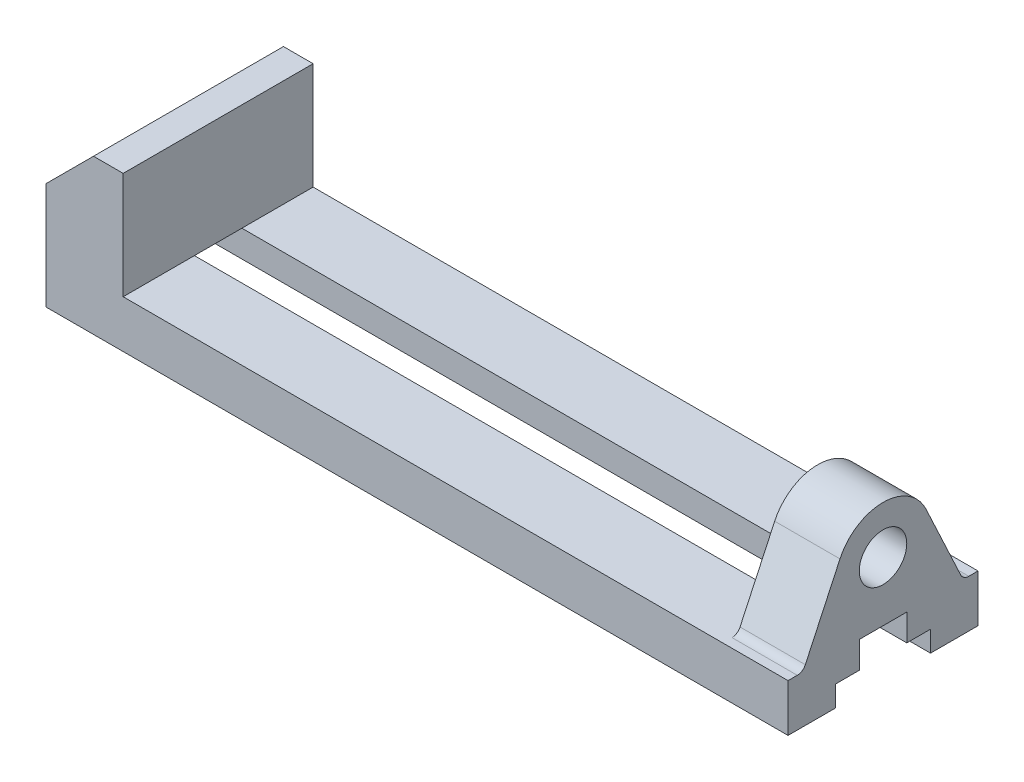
ISO-10303-21;
HEADER;
FILE_DESCRIPTION(('STEP AP214'),'2;1');
FILE_NAME('part.step','',(''),(''),'','','');
FILE_SCHEMA(('AUTOMOTIVE_DESIGN { 1 0 10303 214 1 1 1 1 }'));
ENDSEC;
DATA;
#1=APPLICATION_CONTEXT('core data for automotive mechanical design processes');
#2=APPLICATION_PROTOCOL_DEFINITION('international standard','automotive_design',2000,#1);
#3=PRODUCT_CONTEXT('',#1,'mechanical');
#4=PRODUCT('Part','Part','',(#3));
#5=PRODUCT_RELATED_PRODUCT_CATEGORY('part','',(#4));
#6=PRODUCT_DEFINITION_FORMATION('','',#4);
#7=PRODUCT_DEFINITION_CONTEXT('part definition',#1,'design');
#8=PRODUCT_DEFINITION('design','',#6,#7);
#9=PRODUCT_DEFINITION_SHAPE('','',#8);
#10=(LENGTH_UNIT() NAMED_UNIT(*) SI_UNIT(.MILLI.,.METRE.));
#11=(NAMED_UNIT(*) PLANE_ANGLE_UNIT() SI_UNIT($,.RADIAN.));
#12=(NAMED_UNIT(*) SI_UNIT($,.STERADIAN.) SOLID_ANGLE_UNIT());
#13=UNCERTAINTY_MEASURE_WITH_UNIT(LENGTH_MEASURE(1.E-05),#10,'distance_accuracy_value','');
#14=(GEOMETRIC_REPRESENTATION_CONTEXT(3) GLOBAL_UNCERTAINTY_ASSIGNED_CONTEXT((#13)) GLOBAL_UNIT_ASSIGNED_CONTEXT((#10,
#11,#12)) REPRESENTATION_CONTEXT('',''));
#15=CARTESIAN_POINT('',(0.,0.,0.));
#16=DIRECTION('',(0.,0.,1.));
#17=DIRECTION('',(1.,0.,0.));
#18=AXIS2_PLACEMENT_3D('',#15,#16,#17);
#19=CARTESIAN_POINT('',(0.,0.,32.));
#20=DIRECTION('',(0.,1.,0.));
#21=DIRECTION('',(0.,0.,1.));
#22=AXIS2_PLACEMENT_3D('',#19,#20,#21);
#23=PLANE('',#22);
#24=CARTESIAN_POINT('',(212.,0.,-22.));
#25=DIRECTION('',(0.,1.,0.));
#26=DIRECTION('',(0.,0.,1.));
#27=AXIS2_PLACEMENT_3D('',#24,#25,#26);
#28=CIRCLE('',#27,3.);
#29=CARTESIAN_POINT('',(212.,0.,-19.));
#30=VERTEX_POINT('',#29);
#31=EDGE_CURVE('E221',#30,#30,#28,.T.);
#32=ORIENTED_EDGE('',*,*,#31,.T.);
#33=EDGE_LOOP('',(#32));
#34=FACE_BOUND('',#33,.T.);
#35=DIRECTION('',(0.,0.,-1.));
#36=VECTOR('',#35,1.);
#37=CARTESIAN_POINT('',(250.,0.,32.));
#38=LINE('',#37,#36);
#39=CARTESIAN_POINT('',(250.,0.,-16.));
#40=VERTEX_POINT('',#39);
#41=CARTESIAN_POINT('',(250.,0.,-32.));
#42=VERTEX_POINT('',#41);
#43=EDGE_CURVE('E375',#40,#42,#38,.T.);
#44=ORIENTED_EDGE('',*,*,#43,.F.);
#45=DIRECTION('',(1.,0.,0.));
#46=VECTOR('',#45,1.);
#47=CARTESIAN_POINT('',(0.,0.,-16.));
#48=LINE('',#47,#46);
#49=CARTESIAN_POINT('',(0.,0.,-16.));
#50=VERTEX_POINT('',#49);
#51=EDGE_CURVE('E47',#50,#40,#48,.T.);
#52=ORIENTED_EDGE('',*,*,#51,.F.);
#53=DIRECTION('',(0.,0.,-1.));
#54=VECTOR('',#53,1.);
#55=CARTESIAN_POINT('',(0.,0.,32.));
#56=LINE('',#55,#54);
#57=CARTESIAN_POINT('',(0.,0.,-32.));
#58=VERTEX_POINT('',#57);
#59=EDGE_CURVE('E379',#50,#58,#56,.T.);
#60=ORIENTED_EDGE('',*,*,#59,.T.);
#61=DIRECTION('',(1.,0.,0.));
#62=VECTOR('',#61,1.);
#63=CARTESIAN_POINT('',(0.,0.,-32.));
#64=LINE('',#63,#62);
#65=EDGE_CURVE('E328',#58,#42,#64,.T.);
#66=ORIENTED_EDGE('',*,*,#65,.T.);
#67=EDGE_LOOP('',(#44,#52,#60,#66));
#68=FACE_BOUND('',#67,.T.);
#69=CARTESIAN_POINT('',(142.,0.,-22.));
#70=DIRECTION('',(0.,1.,0.));
#71=DIRECTION('',(0.,0.,1.));
#72=AXIS2_PLACEMENT_3D('',#69,#70,#71);
#73=CIRCLE('',#72,3.);
#74=CARTESIAN_POINT('',(142.,0.,-19.));
#75=VERTEX_POINT('',#74);
#76=EDGE_CURVE('E207',#75,#75,#73,.T.);
#77=ORIENTED_EDGE('',*,*,#76,.T.);
#78=EDGE_LOOP('',(#77));
#79=FACE_BOUND('',#78,.T.);
#80=ADVANCED_FACE('F32',(#34,#68,#79),#23,.F.);
#81=CARTESIAN_POINT('',(212.,0.,22.));
#82=DIRECTION('',(0.,1.,0.));
#83=DIRECTION('',(0.,0.,1.));
#84=AXIS2_PLACEMENT_3D('',#81,#82,#83);
#85=CIRCLE('',#84,3.);
#86=CARTESIAN_POINT('',(212.,0.,25.));
#87=VERTEX_POINT('',#86);
#88=EDGE_CURVE('E227',#87,#87,#85,.T.);
#89=ORIENTED_EDGE('',*,*,#88,.T.);
#90=EDGE_LOOP('',(#89));
#91=FACE_BOUND('',#90,.T.);
#92=CARTESIAN_POINT('',(0.,0.,32.));
#93=VERTEX_POINT('',#92);
#94=CARTESIAN_POINT('',(0.,0.,16.));
#95=VERTEX_POINT('',#94);
#96=EDGE_CURVE('E380',#93,#95,#56,.T.);
#97=ORIENTED_EDGE('',*,*,#96,.T.);
#98=DIRECTION('',(1.,0.,0.));
#99=VECTOR('',#98,1.);
#100=CARTESIAN_POINT('',(0.,0.,16.));
#101=LINE('',#100,#99);
#102=CARTESIAN_POINT('',(250.,0.,16.));
#103=VERTEX_POINT('',#102);
#104=EDGE_CURVE('E270',#95,#103,#101,.T.);
#105=ORIENTED_EDGE('',*,*,#104,.T.);
#106=CARTESIAN_POINT('',(250.,0.,32.));
#107=VERTEX_POINT('',#106);
#108=EDGE_CURVE('E376',#107,#103,#38,.T.);
#109=ORIENTED_EDGE('',*,*,#108,.F.);
#110=DIRECTION('',(1.,0.,0.));
#111=VECTOR('',#110,1.);
#112=CARTESIAN_POINT('',(0.,0.,32.));
#113=LINE('',#112,#111);
#114=EDGE_CURVE('E346',#93,#107,#113,.T.);
#115=ORIENTED_EDGE('',*,*,#114,.F.);
#116=EDGE_LOOP('',(#97,#105,#109,#115));
#117=FACE_BOUND('',#116,.T.);
#118=CARTESIAN_POINT('',(142.,0.,22.));
#119=DIRECTION('',(0.,1.,0.));
#120=DIRECTION('',(0.,0.,1.));
#121=AXIS2_PLACEMENT_3D('',#118,#119,#120);
#122=CIRCLE('',#121,3.);
#123=CARTESIAN_POINT('',(142.,0.,25.));
#124=VERTEX_POINT('',#123);
#125=EDGE_CURVE('E215',#124,#124,#122,.T.);
#126=ORIENTED_EDGE('',*,*,#125,.T.);
#127=EDGE_LOOP('',(#126));
#128=FACE_BOUND('',#127,.T.);
#129=ADVANCED_FACE('F488',(#91,#117,#128),#23,.F.);
#130=CARTESIAN_POINT('',(250.,16.,32.));
#131=DIRECTION('',(0.,-1.,0.));
#132=DIRECTION('',(1.,0.,0.));
#133=AXIS2_PLACEMENT_3D('',#130,#131,#132);
#134=PLANE('',#133);
#135=DIRECTION('',(0.,0.,-1.));
#136=VECTOR('',#135,1.);
#137=CARTESIAN_POINT('',(228.,16.,26.9801998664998));
#138=LINE('',#137,#136);
#139=CARTESIAN_POINT('',(228.,16.,28.8914106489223));
#140=VERTEX_POINT('',#139);
#141=CARTESIAN_POINT('',(228.,16.,8.));
#142=VERTEX_POINT('',#141);
#143=EDGE_CURVE('E314',#140,#142,#138,.T.);
#144=ORIENTED_EDGE('',*,*,#143,.T.);
#145=DIRECTION('',(1.,0.,0.));
#146=VECTOR('',#145,1.);
#147=CARTESIAN_POINT('',(0.,16.,8.));
#148=LINE('',#147,#146);
#149=CARTESIAN_POINT('',(26.,16.,8.));
#150=VERTEX_POINT('',#149);
#151=EDGE_CURVE('E55',#150,#142,#148,.T.);
#152=ORIENTED_EDGE('',*,*,#151,.F.);
#153=DIRECTION('',(0.,0.,-1.));
#154=VECTOR('',#153,1.);
#155=CARTESIAN_POINT('',(26.,16.,32.));
#156=LINE('',#155,#154);
#157=CARTESIAN_POINT('',(26.,16.,32.));
#158=VERTEX_POINT('',#157);
#159=EDGE_CURVE('E368',#158,#150,#156,.T.);
#160=ORIENTED_EDGE('',*,*,#159,.F.);
#161=DIRECTION('',(-1.,0.,0.));
#162=VECTOR('',#161,1.);
#163=CARTESIAN_POINT('',(250.,16.,32.));
#164=LINE('',#163,#162);
#165=CARTESIAN_POINT('',(250.,16.,32.));
#166=VERTEX_POINT('',#165);
#167=EDGE_CURVE('E350',#166,#158,#164,.T.);
#168=ORIENTED_EDGE('',*,*,#167,.F.);
#169=DIRECTION('',(0.,0.,-1.));
#170=VECTOR('',#169,1.);
#171=CARTESIAN_POINT('',(250.,16.,32.));
#172=LINE('',#171,#170);
#173=CARTESIAN_POINT('',(250.,16.,28.8914106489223));
#174=VERTEX_POINT('',#173);
#175=EDGE_CURVE('E372',#166,#174,#172,.T.);
#176=ORIENTED_EDGE('',*,*,#175,.T.);
#177=DIRECTION('',(1.,0.,0.));
#178=VECTOR('',#177,1.);
#179=CARTESIAN_POINT('',(250.,16.,28.8914106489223));
#180=LINE('',#179,#178);
#181=EDGE_CURVE('E383',#174,#140,#180,.F.);
#182=ORIENTED_EDGE('',*,*,#181,.T.);
#183=EDGE_LOOP('',(#144,#152,#160,#168,#176,#182));
#184=FACE_BOUND('',#183,.T.);
#185=ADVANCED_FACE('F408',(#184),#134,.F.);
#186=CARTESIAN_POINT('',(0.,36.,32.));
#187=DIRECTION('',(1.,0.,0.));
#188=DIRECTION('',(0.,1.,0.));
#189=AXIS2_PLACEMENT_3D('',#186,#187,#188);
#190=PLANE('',#189);
#191=DIRECTION('',(0.,0.,1.));
#192=VECTOR('',#191,1.);
#193=CARTESIAN_POINT('',(0.,7.,16.));
#194=LINE('',#193,#192);
#195=CARTESIAN_POINT('',(0.,7.,8.));
#196=VERTEX_POINT('',#195);
#197=CARTESIAN_POINT('',(0.,7.,16.));
#198=VERTEX_POINT('',#197);
#199=EDGE_CURVE('E264',#196,#198,#194,.T.);
#200=ORIENTED_EDGE('',*,*,#199,.T.);
#201=DIRECTION('',(0.,-1.,0.));
#202=VECTOR('',#201,1.);
#203=CARTESIAN_POINT('',(0.,0.,16.));
#204=LINE('',#203,#202);
#205=EDGE_CURVE('E267',#198,#95,#204,.T.);
#206=ORIENTED_EDGE('',*,*,#205,.T.);
#207=ORIENTED_EDGE('',*,*,#96,.F.);
#208=DIRECTION('',(0.,-1.,0.));
#209=VECTOR('',#208,1.);
#210=CARTESIAN_POINT('',(0.,36.,32.));
#211=LINE('',#210,#209);
#212=CARTESIAN_POINT('',(0.,36.,32.));
#213=VERTEX_POINT('',#212);
#214=EDGE_CURVE('E343',#213,#93,#211,.T.);
#215=ORIENTED_EDGE('',*,*,#214,.F.);
#216=DIRECTION('',(0.,0.,-1.));
#217=VECTOR('',#216,1.);
#218=CARTESIAN_POINT('',(0.,36.,32.));
#219=LINE('',#218,#217);
#220=CARTESIAN_POINT('',(0.,36.,-32.));
#221=VERTEX_POINT('',#220);
#222=EDGE_CURVE('E358',#213,#221,#219,.T.);
#223=ORIENTED_EDGE('',*,*,#222,.T.);
#224=DIRECTION('',(0.,-1.,0.));
#225=VECTOR('',#224,1.);
#226=CARTESIAN_POINT('',(0.,36.,-32.));
#227=LINE('',#226,#225);
#228=EDGE_CURVE('E324',#221,#58,#227,.T.);
#229=ORIENTED_EDGE('',*,*,#228,.T.);
#230=ORIENTED_EDGE('',*,*,#59,.F.);
#231=DIRECTION('',(0.,1.,0.));
#232=VECTOR('',#231,1.);
#233=CARTESIAN_POINT('',(0.,0.,-16.));
#234=LINE('',#233,#232);
#235=CARTESIAN_POINT('',(0.,7.,-16.));
#236=VERTEX_POINT('',#235);
#237=EDGE_CURVE('E249',#50,#236,#234,.T.);
#238=ORIENTED_EDGE('',*,*,#237,.T.);
#239=DIRECTION('',(0.,0.,1.));
#240=VECTOR('',#239,1.);
#241=CARTESIAN_POINT('',(0.,7.,-16.));
#242=LINE('',#241,#240);
#243=CARTESIAN_POINT('',(0.,7.,-8.));
#244=VERTEX_POINT('',#243);
#245=EDGE_CURVE('E252',#236,#244,#242,.T.);
#246=ORIENTED_EDGE('',*,*,#245,.T.);
#247=DIRECTION('',(0.,1.,0.));
#248=VECTOR('',#247,1.);
#249=CARTESIAN_POINT('',(0.,7.,-8.));
#250=LINE('',#249,#248);
#251=CARTESIAN_POINT('',(0.,16.,-8.));
#252=VERTEX_POINT('',#251);
#253=EDGE_CURVE('E255',#244,#252,#250,.T.);
#254=ORIENTED_EDGE('',*,*,#253,.T.);
#255=DIRECTION('',(0.,0.,1.));
#256=VECTOR('',#255,1.);
#257=CARTESIAN_POINT('',(0.,16.,8.));
#258=LINE('',#257,#256);
#259=CARTESIAN_POINT('',(0.,16.,8.));
#260=VERTEX_POINT('',#259);
#261=EDGE_CURVE('E258',#252,#260,#258,.T.);
#262=ORIENTED_EDGE('',*,*,#261,.T.);
#263=DIRECTION('',(0.,-1.,0.));
#264=VECTOR('',#263,1.);
#265=CARTESIAN_POINT('',(0.,7.,8.));
#266=LINE('',#265,#264);
#267=EDGE_CURVE('E261',#260,#196,#266,.T.);
#268=ORIENTED_EDGE('',*,*,#267,.T.);
#269=EDGE_LOOP('',(#200,#206,#207,#215,#223,#229,#230,#238,#246,#254,#262,#268));
#270=FACE_BOUND('',#269,.T.);
#271=ADVANCED_FACE('F34',(#270),#190,.F.);
#272=CARTESIAN_POINT('',(250.,0.,32.));
#273=DIRECTION('',(-1.,0.,0.));
#274=DIRECTION('',(0.,0.,1.));
#275=AXIS2_PLACEMENT_3D('',#272,#273,#274);
#276=PLANE('',#275);
#277=CARTESIAN_POINT('',(250.,36.,0.));
#278=DIRECTION('',(1.,0.,0.));
#279=DIRECTION('',(0.,0.,-1.));
#280=AXIS2_PLACEMENT_3D('',#277,#278,#279);
#281=CIRCLE('',#280,8.);
#282=CARTESIAN_POINT('',(250.,36.,-8.));
#283=VERTEX_POINT('',#282);
#284=EDGE_CURVE('E296',#283,#283,#281,.T.);
#285=ORIENTED_EDGE('',*,*,#284,.F.);
#286=EDGE_LOOP('',(#285));
#287=FACE_BOUND('',#286,.T.);
#288=ORIENTED_EDGE('',*,*,#108,.T.);
#289=DIRECTION('',(0.,-1.,0.));
#290=VECTOR('',#289,1.);
#291=CARTESIAN_POINT('',(250.,0.,16.));
#292=LINE('',#291,#290);
#293=CARTESIAN_POINT('',(250.,7.,16.));
#294=VERTEX_POINT('',#293);
#295=EDGE_CURVE('E247',#294,#103,#292,.T.);
#296=ORIENTED_EDGE('',*,*,#295,.F.);
#297=DIRECTION('',(0.,0.,1.));
#298=VECTOR('',#297,1.);
#299=CARTESIAN_POINT('',(250.,7.,16.));
#300=LINE('',#299,#298);
#301=CARTESIAN_POINT('',(250.,7.,8.));
#302=VERTEX_POINT('',#301);
#303=EDGE_CURVE('E244',#302,#294,#300,.T.);
#304=ORIENTED_EDGE('',*,*,#303,.F.);
#305=DIRECTION('',(0.,-1.,0.));
#306=VECTOR('',#305,1.);
#307=CARTESIAN_POINT('',(250.,7.,8.));
#308=LINE('',#307,#306);
#309=CARTESIAN_POINT('',(250.,16.,8.));
#310=VERTEX_POINT('',#309);
#311=EDGE_CURVE('E241',#310,#302,#308,.T.);
#312=ORIENTED_EDGE('',*,*,#311,.F.);
#313=DIRECTION('',(0.,0.,1.));
#314=VECTOR('',#313,1.);
#315=CARTESIAN_POINT('',(250.,16.,8.));
#316=LINE('',#315,#314);
#317=CARTESIAN_POINT('',(250.,16.,-8.));
#318=VERTEX_POINT('',#317);
#319=EDGE_CURVE('E238',#318,#310,#316,.T.);
#320=ORIENTED_EDGE('',*,*,#319,.F.);
#321=DIRECTION('',(0.,1.,0.));
#322=VECTOR('',#321,1.);
#323=CARTESIAN_POINT('',(250.,7.,-8.));
#324=LINE('',#323,#322);
#325=CARTESIAN_POINT('',(250.,7.,-8.));
#326=VERTEX_POINT('',#325);
#327=EDGE_CURVE('E235',#326,#318,#324,.T.);
#328=ORIENTED_EDGE('',*,*,#327,.F.);
#329=DIRECTION('',(0.,0.,1.));
#330=VECTOR('',#329,1.);
#331=CARTESIAN_POINT('',(250.,7.,-16.));
#332=LINE('',#331,#330);
#333=CARTESIAN_POINT('',(250.,7.,-16.));
#334=VERTEX_POINT('',#333);
#335=EDGE_CURVE('E232',#334,#326,#332,.T.);
#336=ORIENTED_EDGE('',*,*,#335,.F.);
#337=DIRECTION('',(0.,1.,0.));
#338=VECTOR('',#337,1.);
#339=CARTESIAN_POINT('',(250.,0.,-16.));
#340=LINE('',#339,#338);
#341=EDGE_CURVE('E230',#40,#334,#340,.T.);
#342=ORIENTED_EDGE('',*,*,#341,.F.);
#343=ORIENTED_EDGE('',*,*,#43,.T.);
#344=DIRECTION('',(0.,1.,0.));
#345=VECTOR('',#344,1.);
#346=CARTESIAN_POINT('',(250.,0.,-32.));
#347=LINE('',#346,#345);
#348=CARTESIAN_POINT('',(250.,16.,-32.));
#349=VERTEX_POINT('',#348);
#350=EDGE_CURVE('E331',#42,#349,#347,.T.);
#351=ORIENTED_EDGE('',*,*,#350,.T.);
#352=CARTESIAN_POINT('',(250.,16.,-28.8914106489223));
#353=VERTEX_POINT('',#352);
#354=EDGE_CURVE('E371',#353,#349,#172,.T.);
#355=ORIENTED_EDGE('',*,*,#354,.F.);
#356=CARTESIAN_POINT('',(250.,19.,-28.8914106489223));
#357=DIRECTION('',(-1.,0.,0.));
#358=DIRECTION('',(0.,0.,1.));
#359=AXIS2_PLACEMENT_3D('',#356,#357,#358);
#360=CIRCLE('',#359,3.);
#361=CARTESIAN_POINT('',(250.,17.7321452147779,-26.1724872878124));
#362=VERTEX_POINT('',#361);
#363=EDGE_CURVE('E394',#353,#362,#360,.T.);
#364=ORIENTED_EDGE('',*,*,#363,.T.);
#365=DIRECTION('',(0.,0.906307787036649,0.4226182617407));
#366=VECTOR('',#365,1.);
#367=CARTESIAN_POINT('',(250.,42.7618921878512,-14.5009245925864));
#368=LINE('',#367,#366);
#369=CARTESIAN_POINT('',(250.,42.7618921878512,-14.5009245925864));
#370=VERTEX_POINT('',#369);
#371=EDGE_CURVE('E305',#362,#370,#368,.T.);
#372=ORIENTED_EDGE('',*,*,#371,.T.);
#373=CARTESIAN_POINT('',(250.,36.,0.));
#374=DIRECTION('',(1.,0.,0.));
#375=DIRECTION('',(0.,0.,-1.));
#376=AXIS2_PLACEMENT_3D('',#373,#374,#375);
#377=CIRCLE('',#376,16.);
#378=CARTESIAN_POINT('',(250.,42.7618921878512,14.5009245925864));
#379=VERTEX_POINT('',#378);
#380=EDGE_CURVE('E299',#370,#379,#377,.T.);
#381=ORIENTED_EDGE('',*,*,#380,.T.);
#382=DIRECTION('',(0.,-0.90630778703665,0.4226182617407));
#383=VECTOR('',#382,1.);
#384=CARTESIAN_POINT('',(250.,42.7618921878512,14.5009245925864));
#385=LINE('',#384,#383);
#386=CARTESIAN_POINT('',(250.,17.7321452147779,26.1724872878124));
#387=VERTEX_POINT('',#386);
#388=EDGE_CURVE('E302',#379,#387,#385,.T.);
#389=ORIENTED_EDGE('',*,*,#388,.T.);
#390=CARTESIAN_POINT('',(250.,19.,28.8914106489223));
#391=DIRECTION('',(-1.,0.,0.));
#392=DIRECTION('',(0.,0.,1.));
#393=AXIS2_PLACEMENT_3D('',#390,#391,#392);
#394=CIRCLE('',#393,3.);
#395=EDGE_CURVE('E40',#387,#174,#394,.T.);
#396=ORIENTED_EDGE('',*,*,#395,.T.);
#397=ORIENTED_EDGE('',*,*,#175,.F.);
#398=DIRECTION('',(0.,1.,0.));
#399=VECTOR('',#398,1.);
#400=CARTESIAN_POINT('',(250.,0.,32.));
#401=LINE('',#400,#399);
#402=EDGE_CURVE('E348',#107,#166,#401,.T.);
#403=ORIENTED_EDGE('',*,*,#402,.F.);
#404=EDGE_LOOP('',(#288,#296,#304,#312,#320,#328,#336,#342,#343,#351,#355,#364,#372,#381,#389,
#396,#397,#403));
#405=FACE_BOUND('',#404,.T.);
#406=ADVANCED_FACE('F400',(#287,#405),#276,.F.);
#407=CARTESIAN_POINT('',(26.,16.,-8.));
#408=VERTEX_POINT('',#407);
#409=CARTESIAN_POINT('',(26.,16.,-32.));
#410=VERTEX_POINT('',#409);
#411=EDGE_CURVE('E367',#408,#410,#156,.T.);
#412=ORIENTED_EDGE('',*,*,#411,.F.);
#413=DIRECTION('',(1.,0.,0.));
#414=VECTOR('',#413,1.);
#415=CARTESIAN_POINT('',(0.,16.,-8.));
#416=LINE('',#415,#414);
#417=CARTESIAN_POINT('',(228.,16.,-8.));
#418=VERTEX_POINT('',#417);
#419=EDGE_CURVE('E284',#408,#418,#416,.T.);
#420=ORIENTED_EDGE('',*,*,#419,.T.);
#421=CARTESIAN_POINT('',(228.,16.,-28.8914106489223));
#422=VERTEX_POINT('',#421);
#423=EDGE_CURVE('E313',#418,#422,#138,.T.);
#424=ORIENTED_EDGE('',*,*,#423,.T.);
#425=DIRECTION('',(1.,0.,0.));
#426=VECTOR('',#425,1.);
#427=CARTESIAN_POINT('',(250.,16.,-28.8914106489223));
#428=LINE('',#427,#426);
#429=EDGE_CURVE('E386',#422,#353,#428,.T.);
#430=ORIENTED_EDGE('',*,*,#429,.T.);
#431=ORIENTED_EDGE('',*,*,#354,.T.);
#432=DIRECTION('',(-1.,0.,0.));
#433=VECTOR('',#432,1.);
#434=CARTESIAN_POINT('',(250.,16.,-32.));
#435=LINE('',#434,#433);
#436=EDGE_CURVE('E334',#349,#410,#435,.T.);
#437=ORIENTED_EDGE('',*,*,#436,.T.);
#438=EDGE_LOOP('',(#412,#420,#424,#430,#431,#437));
#439=FACE_BOUND('',#438,.T.);
#440=ADVANCED_FACE('F434',(#439),#134,.F.);
#441=CARTESIAN_POINT('',(26.,16.,32.));
#442=DIRECTION('',(-1.,0.,0.));
#443=DIRECTION('',(0.,-1.,0.));
#444=AXIS2_PLACEMENT_3D('',#441,#442,#443);
#445=PLANE('',#444);
#446=DIRECTION('',(0.,1.,0.));
#447=VECTOR('',#446,1.);
#448=CARTESIAN_POINT('',(26.,16.,-32.));
#449=LINE('',#448,#447);
#450=CARTESIAN_POINT('',(26.,52.,-32.));
#451=VERTEX_POINT('',#450);
#452=EDGE_CURVE('E337',#410,#451,#449,.T.);
#453=ORIENTED_EDGE('',*,*,#452,.T.);
#454=DIRECTION('',(0.,0.,-1.));
#455=VECTOR('',#454,1.);
#456=CARTESIAN_POINT('',(26.,52.,32.));
#457=LINE('',#456,#455);
#458=CARTESIAN_POINT('',(26.,52.,32.));
#459=VERTEX_POINT('',#458);
#460=EDGE_CURVE('E364',#459,#451,#457,.T.);
#461=ORIENTED_EDGE('',*,*,#460,.F.);
#462=DIRECTION('',(0.,1.,0.));
#463=VECTOR('',#462,1.);
#464=CARTESIAN_POINT('',(26.,16.,32.));
#465=LINE('',#464,#463);
#466=EDGE_CURVE('E352',#158,#459,#465,.T.);
#467=ORIENTED_EDGE('',*,*,#466,.F.);
#468=ORIENTED_EDGE('',*,*,#159,.T.);
#469=DIRECTION('',(0.,0.,-1.));
#470=VECTOR('',#469,1.);
#471=CARTESIAN_POINT('',(26.,16.,32.));
#472=LINE('',#471,#470);
#473=EDGE_CURVE('E273',#150,#408,#472,.T.);
#474=ORIENTED_EDGE('',*,*,#473,.T.);
#475=ORIENTED_EDGE('',*,*,#411,.T.);
#476=EDGE_LOOP('',(#453,#461,#467,#468,#474,#475));
#477=FACE_BOUND('',#476,.T.);
#478=ADVANCED_FACE('F447',(#477),#445,.F.);
#479=CARTESIAN_POINT('',(26.,52.,32.));
#480=DIRECTION('',(0.,-1.,0.));
#481=DIRECTION('',(0.,0.,-1.));
#482=AXIS2_PLACEMENT_3D('',#479,#480,#481);
#483=PLANE('',#482);
#484=DIRECTION('',(-1.,0.,0.));
#485=VECTOR('',#484,1.);
#486=CARTESIAN_POINT('',(26.,52.,-32.));
#487=LINE('',#486,#485);
#488=CARTESIAN_POINT('',(16.,52.,-32.));
#489=VERTEX_POINT('',#488);
#490=EDGE_CURVE('E339',#451,#489,#487,.T.);
#491=ORIENTED_EDGE('',*,*,#490,.T.);
#492=DIRECTION('',(0.,0.,-1.));
#493=VECTOR('',#492,1.);
#494=CARTESIAN_POINT('',(16.,52.,32.));
#495=LINE('',#494,#493);
#496=CARTESIAN_POINT('',(16.,52.,32.));
#497=VERTEX_POINT('',#496);
#498=EDGE_CURVE('E361',#497,#489,#495,.T.);
#499=ORIENTED_EDGE('',*,*,#498,.F.);
#500=DIRECTION('',(-1.,0.,0.));
#501=VECTOR('',#500,1.);
#502=CARTESIAN_POINT('',(26.,52.,32.));
#503=LINE('',#502,#501);
#504=EDGE_CURVE('E354',#459,#497,#503,.T.);
#505=ORIENTED_EDGE('',*,*,#504,.F.);
#506=ORIENTED_EDGE('',*,*,#460,.T.);
#507=EDGE_LOOP('',(#491,#499,#505,#506));
#508=FACE_BOUND('',#507,.T.);
#509=ADVANCED_FACE('F503',(#508),#483,.F.);
#510=CARTESIAN_POINT('',(16.,52.,32.));
#511=DIRECTION('',(0.707106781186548,-0.707106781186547,0.));
#512=DIRECTION('',(0.707106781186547,0.707106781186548,0.));
#513=AXIS2_PLACEMENT_3D('',#510,#511,#512);
#514=PLANE('',#513);
#515=DIRECTION('',(-0.707106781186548,-0.707106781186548,0.));
#516=VECTOR('',#515,1.);
#517=CARTESIAN_POINT('',(16.,52.,-32.));
#518=LINE('',#517,#516);
#519=EDGE_CURVE('E341',#489,#221,#518,.T.);
#520=ORIENTED_EDGE('',*,*,#519,.T.);
#521=ORIENTED_EDGE('',*,*,#222,.F.);
#522=DIRECTION('',(-0.707106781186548,-0.707106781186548,0.));
#523=VECTOR('',#522,1.);
#524=CARTESIAN_POINT('',(16.,52.,32.));
#525=LINE('',#524,#523);
#526=EDGE_CURVE('E356',#497,#213,#525,.T.);
#527=ORIENTED_EDGE('',*,*,#526,.F.);
#528=ORIENTED_EDGE('',*,*,#498,.T.);
#529=EDGE_LOOP('',(#520,#521,#527,#528));
#530=FACE_BOUND('',#529,.T.);
#531=ADVANCED_FACE('F506',(#530),#514,.F.);
#532=CARTESIAN_POINT('',(0.,0.,32.));
#533=DIRECTION('',(0.,0.,1.));
#534=DIRECTION('',(1.,0.,0.));
#535=AXIS2_PLACEMENT_3D('',#532,#533,#534);
#536=PLANE('',#535);
#537=ORIENTED_EDGE('',*,*,#214,.T.);
#538=ORIENTED_EDGE('',*,*,#114,.T.);
#539=ORIENTED_EDGE('',*,*,#402,.T.);
#540=ORIENTED_EDGE('',*,*,#167,.T.);
#541=ORIENTED_EDGE('',*,*,#466,.T.);
#542=ORIENTED_EDGE('',*,*,#504,.T.);
#543=ORIENTED_EDGE('',*,*,#526,.T.);
#544=EDGE_LOOP('',(#537,#538,#539,#540,#541,#542,#543));
#545=FACE_BOUND('',#544,.T.);
#546=ADVANCED_FACE('F510',(#545),#536,.T.);
#547=CARTESIAN_POINT('',(0.,0.,-32.));
#548=DIRECTION('',(0.,0.,1.));
#549=DIRECTION('',(1.,0.,0.));
#550=AXIS2_PLACEMENT_3D('',#547,#548,#549);
#551=PLANE('',#550);
#552=ORIENTED_EDGE('',*,*,#228,.F.);
#553=ORIENTED_EDGE('',*,*,#519,.F.);
#554=ORIENTED_EDGE('',*,*,#490,.F.);
#555=ORIENTED_EDGE('',*,*,#452,.F.);
#556=ORIENTED_EDGE('',*,*,#436,.F.);
#557=ORIENTED_EDGE('',*,*,#350,.F.);
#558=ORIENTED_EDGE('',*,*,#65,.F.);
#559=EDGE_LOOP('',(#552,#553,#554,#555,#556,#557,#558));
#560=FACE_BOUND('',#559,.T.);
#561=ADVANCED_FACE('F444',(#560),#551,.F.);
#562=CARTESIAN_POINT('',(228.,36.,0.));
#563=DIRECTION('',(1.,0.,0.));
#564=DIRECTION('',(0.,0.,-1.));
#565=AXIS2_PLACEMENT_3D('',#562,#563,#564);
#566=CYLINDRICAL_SURFACE('',#565,16.);
#567=ORIENTED_EDGE('',*,*,#380,.F.);
#568=DIRECTION('',(1.,0.,0.));
#569=VECTOR('',#568,1.);
#570=CARTESIAN_POINT('',(228.,42.7618921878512,-14.5009245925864));
#571=LINE('',#570,#569);
#572=CARTESIAN_POINT('',(228.,42.7618921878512,-14.5009245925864));
#573=VERTEX_POINT('',#572);
#574=EDGE_CURVE('E321',#573,#370,#571,.T.);
#575=ORIENTED_EDGE('',*,*,#574,.F.);
#576=CARTESIAN_POINT('',(228.,36.,0.));
#577=DIRECTION('',(1.,0.,0.));
#578=DIRECTION('',(0.,0.,-1.));
#579=AXIS2_PLACEMENT_3D('',#576,#577,#578);
#580=CIRCLE('',#579,16.);
#581=CARTESIAN_POINT('',(228.,42.7618921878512,14.5009245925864));
#582=VERTEX_POINT('',#581);
#583=EDGE_CURVE('E307',#573,#582,#580,.T.);
#584=ORIENTED_EDGE('',*,*,#583,.T.);
#585=DIRECTION('',(1.,0.,0.));
#586=VECTOR('',#585,1.);
#587=CARTESIAN_POINT('',(228.,42.7618921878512,14.5009245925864));
#588=LINE('',#587,#586);
#589=EDGE_CURVE('E320',#582,#379,#588,.T.);
#590=ORIENTED_EDGE('',*,*,#589,.T.);
#591=EDGE_LOOP('',(#567,#575,#584,#590));
#592=FACE_BOUND('',#591,.T.);
#593=ADVANCED_FACE('F421',(#592),#566,.T.);
#594=CARTESIAN_POINT('',(228.,42.7618921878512,-14.5009245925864));
#595=DIRECTION('',(0.,0.4226182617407,-0.90630778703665));
#596=DIRECTION('',(0.,0.90630778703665,0.4226182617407));
#597=AXIS2_PLACEMENT_3D('',#594,#595,#596);
#598=PLANE('',#597);
#599=ORIENTED_EDGE('',*,*,#371,.F.);
#600=DIRECTION('',(1.,0.,0.));
#601=VECTOR('',#600,1.);
#602=CARTESIAN_POINT('',(228.,17.7321452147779,-26.1724872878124));
#603=LINE('',#602,#601);
#604=CARTESIAN_POINT('',(228.,17.7321452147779,-26.1724872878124));
#605=VERTEX_POINT('',#604);
#606=EDGE_CURVE('E389',#362,#605,#603,.F.);
#607=ORIENTED_EDGE('',*,*,#606,.T.);
#608=DIRECTION('',(0.,0.906307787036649,0.4226182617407));
#609=VECTOR('',#608,1.);
#610=CARTESIAN_POINT('',(228.,42.7618921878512,-14.5009245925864));
#611=LINE('',#610,#609);
#612=EDGE_CURVE('E317',#605,#573,#611,.T.);
#613=ORIENTED_EDGE('',*,*,#612,.T.);
#614=ORIENTED_EDGE('',*,*,#574,.T.);
#615=EDGE_LOOP('',(#599,#607,#613,#614));
#616=FACE_BOUND('',#615,.T.);
#617=ADVANCED_FACE('F519',(#616),#598,.T.);
#618=CARTESIAN_POINT('',(228.,42.7618921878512,14.5009245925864));
#619=DIRECTION('',(0.,0.4226182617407,0.90630778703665));
#620=DIRECTION('',(0.,-0.90630778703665,0.4226182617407));
#621=AXIS2_PLACEMENT_3D('',#618,#619,#620);
#622=PLANE('',#621);
#623=DIRECTION('',(0.,-0.90630778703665,0.4226182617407));
#624=VECTOR('',#623,1.);
#625=CARTESIAN_POINT('',(228.,42.7618921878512,14.5009245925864));
#626=LINE('',#625,#624);
#627=CARTESIAN_POINT('',(228.,17.7321452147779,26.1724872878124));
#628=VERTEX_POINT('',#627);
#629=EDGE_CURVE('E310',#582,#628,#626,.T.);
#630=ORIENTED_EDGE('',*,*,#629,.T.);
#631=DIRECTION('',(1.,0.,0.));
#632=VECTOR('',#631,1.);
#633=CARTESIAN_POINT('',(228.,17.7321452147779,26.1724872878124));
#634=LINE('',#633,#632);
#635=EDGE_CURVE('E391',#628,#387,#634,.T.);
#636=ORIENTED_EDGE('',*,*,#635,.T.);
#637=ORIENTED_EDGE('',*,*,#388,.F.);
#638=ORIENTED_EDGE('',*,*,#589,.F.);
#639=EDGE_LOOP('',(#630,#636,#637,#638));
#640=FACE_BOUND('',#639,.T.);
#641=ADVANCED_FACE('F418',(#640),#622,.T.);
#642=CARTESIAN_POINT('',(228.,36.,0.));
#643=DIRECTION('',(1.,0.,0.));
#644=DIRECTION('',(0.,0.,-1.));
#645=AXIS2_PLACEMENT_3D('',#642,#643,#644);
#646=PLANE('',#645);
#647=CARTESIAN_POINT('',(228.,36.,0.));
#648=DIRECTION('',(1.,0.,0.));
#649=DIRECTION('',(0.,0.,-1.));
#650=AXIS2_PLACEMENT_3D('',#647,#648,#649);
#651=CIRCLE('',#650,8.);
#652=CARTESIAN_POINT('',(228.,36.,-8.));
#653=VERTEX_POINT('',#652);
#654=EDGE_CURVE('E293',#653,#653,#651,.F.);
#655=ORIENTED_EDGE('',*,*,#654,.F.);
#656=EDGE_LOOP('',(#655));
#657=FACE_BOUND('',#656,.T.);
#658=ORIENTED_EDGE('',*,*,#583,.F.);
#659=ORIENTED_EDGE('',*,*,#612,.F.);
#660=CARTESIAN_POINT('',(228.,19.,-28.8914106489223));
#661=DIRECTION('',(1.,0.,0.));
#662=DIRECTION('',(0.,0.,-1.));
#663=AXIS2_PLACEMENT_3D('',#660,#661,#662);
#664=CIRCLE('',#663,3.);
#665=EDGE_CURVE('E396',#605,#422,#664,.T.);
#666=ORIENTED_EDGE('',*,*,#665,.T.);
#667=ORIENTED_EDGE('',*,*,#423,.F.);
#668=EDGE_CURVE('E318',#142,#418,#138,.T.);
#669=ORIENTED_EDGE('',*,*,#668,.F.);
#670=ORIENTED_EDGE('',*,*,#143,.F.);
#671=CARTESIAN_POINT('',(228.,19.,28.8914106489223));
#672=DIRECTION('',(1.,0.,0.));
#673=DIRECTION('',(0.,0.,-1.));
#674=AXIS2_PLACEMENT_3D('',#671,#672,#673);
#675=CIRCLE('',#674,3.);
#676=EDGE_CURVE('E11',#140,#628,#675,.T.);
#677=ORIENTED_EDGE('',*,*,#676,.T.);
#678=ORIENTED_EDGE('',*,*,#629,.F.);
#679=EDGE_LOOP('',(#658,#659,#666,#667,#669,#670,#677,#678));
#680=FACE_BOUND('',#679,.T.);
#681=ADVANCED_FACE('F415',(#657,#680),#646,.F.);
#682=CARTESIAN_POINT('',(250.,19.,-28.8914106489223));
#683=DIRECTION('',(1.,0.,0.));
#684=DIRECTION('',(0.,1.,0.));
#685=AXIS2_PLACEMENT_3D('',#682,#683,#684);
#686=CYLINDRICAL_SURFACE('',#685,3.);
#687=ORIENTED_EDGE('',*,*,#665,.F.);
#688=ORIENTED_EDGE('',*,*,#606,.F.);
#689=ORIENTED_EDGE('',*,*,#363,.F.);
#690=ORIENTED_EDGE('',*,*,#429,.F.);
#691=EDGE_LOOP('',(#687,#688,#689,#690));
#692=FACE_BOUND('',#691,.T.);
#693=ADVANCED_FACE('F430',(#692),#686,.F.);
#694=CARTESIAN_POINT('',(228.,19.,28.8914106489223));
#695=DIRECTION('',(1.,0.,0.));
#696=DIRECTION('',(0.,1.,0.));
#697=AXIS2_PLACEMENT_3D('',#694,#695,#696);
#698=CYLINDRICAL_SURFACE('',#697,3.);
#699=ORIENTED_EDGE('',*,*,#676,.F.);
#700=ORIENTED_EDGE('',*,*,#181,.F.);
#701=ORIENTED_EDGE('',*,*,#395,.F.);
#702=ORIENTED_EDGE('',*,*,#635,.F.);
#703=EDGE_LOOP('',(#699,#700,#701,#702));
#704=FACE_BOUND('',#703,.T.);
#705=ADVANCED_FACE('F411',(#704),#698,.F.);
#706=CARTESIAN_POINT('',(-0.000999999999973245,36.,0.));
#707=DIRECTION('',(1.,0.,0.));
#708=DIRECTION('',(0.,0.,-1.));
#709=AXIS2_PLACEMENT_3D('',#706,#707,#708);
#710=CYLINDRICAL_SURFACE('',#709,8.);
#711=ORIENTED_EDGE('',*,*,#284,.T.);
#712=EDGE_LOOP('',(#711));
#713=FACE_BOUND('',#712,.T.);
#714=ORIENTED_EDGE('',*,*,#654,.T.);
#715=EDGE_LOOP('',(#714));
#716=FACE_BOUND('',#715,.T.);
#717=ADVANCED_FACE('F530',(#713,#716),#710,.F.);
#718=CARTESIAN_POINT('',(0.,16.,8.));
#719=DIRECTION('',(0.,1.,0.));
#720=DIRECTION('',(0.,0.,1.));
#721=AXIS2_PLACEMENT_3D('',#718,#719,#720);
#722=PLANE('',#721);
#723=EDGE_CURVE('E278',#260,#150,#148,.T.);
#724=ORIENTED_EDGE('',*,*,#723,.F.);
#725=ORIENTED_EDGE('',*,*,#261,.F.);
#726=EDGE_CURVE('E281',#252,#408,#416,.T.);
#727=ORIENTED_EDGE('',*,*,#726,.T.);
#728=ORIENTED_EDGE('',*,*,#473,.F.);
#729=EDGE_LOOP('',(#724,#725,#727,#728));
#730=FACE_BOUND('',#729,.T.);
#731=ADVANCED_FACE('F450',(#730),#722,.F.);
#732=EDGE_CURVE('E285',#418,#318,#416,.T.);
#733=ORIENTED_EDGE('',*,*,#732,.T.);
#734=ORIENTED_EDGE('',*,*,#319,.T.);
#735=EDGE_CURVE('E280',#142,#310,#148,.T.);
#736=ORIENTED_EDGE('',*,*,#735,.F.);
#737=ORIENTED_EDGE('',*,*,#668,.T.);
#738=EDGE_LOOP('',(#733,#734,#736,#737));
#739=FACE_BOUND('',#738,.T.);
#740=ADVANCED_FACE('F458',(#739),#722,.F.);
#741=CARTESIAN_POINT('',(0.,0.,16.));
#742=DIRECTION('',(0.,0.,1.));
#743=DIRECTION('',(1.,0.,0.));
#744=AXIS2_PLACEMENT_3D('',#741,#742,#743);
#745=PLANE('',#744);
#746=ORIENTED_EDGE('',*,*,#295,.T.);
#747=ORIENTED_EDGE('',*,*,#104,.F.);
#748=ORIENTED_EDGE('',*,*,#205,.F.);
#749=DIRECTION('',(1.,0.,0.));
#750=VECTOR('',#749,1.);
#751=CARTESIAN_POINT('',(0.,7.,16.));
#752=LINE('',#751,#750);
#753=EDGE_CURVE('E274',#198,#294,#752,.T.);
#754=ORIENTED_EDGE('',*,*,#753,.T.);
#755=EDGE_LOOP('',(#746,#747,#748,#754));
#756=FACE_BOUND('',#755,.T.);
#757=ADVANCED_FACE('F543',(#756),#745,.F.);
#758=CARTESIAN_POINT('',(0.,7.,16.));
#759=DIRECTION('',(0.,1.,0.));
#760=DIRECTION('',(0.,0.,1.));
#761=AXIS2_PLACEMENT_3D('',#758,#759,#760);
#762=PLANE('',#761);
#763=ORIENTED_EDGE('',*,*,#303,.T.);
#764=ORIENTED_EDGE('',*,*,#753,.F.);
#765=ORIENTED_EDGE('',*,*,#199,.F.);
#766=DIRECTION('',(1.,0.,0.));
#767=VECTOR('',#766,1.);
#768=CARTESIAN_POINT('',(0.,7.,8.));
#769=LINE('',#768,#767);
#770=EDGE_CURVE('E276',#196,#302,#769,.T.);
#771=ORIENTED_EDGE('',*,*,#770,.T.);
#772=EDGE_LOOP('',(#763,#764,#765,#771));
#773=FACE_BOUND('',#772,.T.);
#774=ADVANCED_FACE('F463',(#773),#762,.F.);
#775=CARTESIAN_POINT('',(0.,7.,8.));
#776=DIRECTION('',(0.,0.,1.));
#777=DIRECTION('',(1.,0.,0.));
#778=AXIS2_PLACEMENT_3D('',#775,#776,#777);
#779=PLANE('',#778);
#780=ORIENTED_EDGE('',*,*,#311,.T.);
#781=ORIENTED_EDGE('',*,*,#770,.F.);
#782=ORIENTED_EDGE('',*,*,#267,.F.);
#783=ORIENTED_EDGE('',*,*,#723,.T.);
#784=ORIENTED_EDGE('',*,*,#151,.T.);
#785=ORIENTED_EDGE('',*,*,#735,.T.);
#786=EDGE_LOOP('',(#780,#781,#782,#783,#784,#785));
#787=FACE_BOUND('',#786,.T.);
#788=ADVANCED_FACE('F453',(#787),#779,.F.);
#789=CARTESIAN_POINT('',(0.,7.,-8.));
#790=DIRECTION('',(0.,0.,-1.));
#791=DIRECTION('',(-1.,0.,0.));
#792=AXIS2_PLACEMENT_3D('',#789,#790,#791);
#793=PLANE('',#792);
#794=ORIENTED_EDGE('',*,*,#327,.T.);
#795=ORIENTED_EDGE('',*,*,#732,.F.);
#796=ORIENTED_EDGE('',*,*,#419,.F.);
#797=ORIENTED_EDGE('',*,*,#726,.F.);
#798=ORIENTED_EDGE('',*,*,#253,.F.);
#799=DIRECTION('',(1.,0.,0.));
#800=VECTOR('',#799,1.);
#801=CARTESIAN_POINT('',(0.,7.,-8.));
#802=LINE('',#801,#800);
#803=EDGE_CURVE('E286',#244,#326,#802,.T.);
#804=ORIENTED_EDGE('',*,*,#803,.T.);
#805=EDGE_LOOP('',(#794,#795,#796,#797,#798,#804));
#806=FACE_BOUND('',#805,.T.);
#807=ADVANCED_FACE('F470',(#806),#793,.F.);
#808=CARTESIAN_POINT('',(0.,7.,-16.));
#809=DIRECTION('',(0.,1.,0.));
#810=DIRECTION('',(0.,0.,1.));
#811=AXIS2_PLACEMENT_3D('',#808,#809,#810);
#812=PLANE('',#811);
#813=ORIENTED_EDGE('',*,*,#335,.T.);
#814=ORIENTED_EDGE('',*,*,#803,.F.);
#815=ORIENTED_EDGE('',*,*,#245,.F.);
#816=DIRECTION('',(1.,0.,0.));
#817=VECTOR('',#816,1.);
#818=CARTESIAN_POINT('',(0.,7.,-16.));
#819=LINE('',#818,#817);
#820=EDGE_CURVE('E288',#236,#334,#819,.T.);
#821=ORIENTED_EDGE('',*,*,#820,.T.);
#822=EDGE_LOOP('',(#813,#814,#815,#821));
#823=FACE_BOUND('',#822,.T.);
#824=ADVANCED_FACE('F473',(#823),#812,.F.);
#825=CARTESIAN_POINT('',(0.,0.,-16.));
#826=DIRECTION('',(0.,0.,-1.));
#827=DIRECTION('',(-1.,0.,0.));
#828=AXIS2_PLACEMENT_3D('',#825,#826,#827);
#829=PLANE('',#828);
#830=ORIENTED_EDGE('',*,*,#341,.T.);
#831=ORIENTED_EDGE('',*,*,#820,.F.);
#832=ORIENTED_EDGE('',*,*,#237,.F.);
#833=ORIENTED_EDGE('',*,*,#51,.T.);
#834=EDGE_LOOP('',(#830,#831,#832,#833));
#835=FACE_BOUND('',#834,.T.);
#836=ADVANCED_FACE('F474',(#835),#829,.F.);
#837=CARTESIAN_POINT('',(212.,26.4839292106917,22.));
#838=DIRECTION('',(0.,1.,0.));
#839=DIRECTION('',(0.,0.,1.));
#840=AXIS2_PLACEMENT_3D('',#837,#838,#839);
#841=CYLINDRICAL_SURFACE('',#840,2.99999999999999);
#842=CARTESIAN_POINT('',(212.,10.,22.));
#843=DIRECTION('',(0.,1.,0.));
#844=DIRECTION('',(0.,0.,1.));
#845=AXIS2_PLACEMENT_3D('',#842,#843,#844);
#846=CIRCLE('',#845,2.99999999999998);
#847=CARTESIAN_POINT('',(212.,10.,25.));
#848=VERTEX_POINT('',#847);
#849=EDGE_CURVE('E224',#848,#848,#846,.T.);
#850=ORIENTED_EDGE('',*,*,#849,.T.);
#851=EDGE_LOOP('',(#850));
#852=FACE_BOUND('',#851,.T.);
#853=ORIENTED_EDGE('',*,*,#88,.F.);
#854=EDGE_LOOP('',(#853));
#855=FACE_BOUND('',#854,.T.);
#856=ADVANCED_FACE('F476',(#852,#855),#841,.F.);
#857=CARTESIAN_POINT('',(212.,10.,22.));
#858=DIRECTION('',(0.,-1.,0.));
#859=DIRECTION('',(0.,0.,-1.));
#860=AXIS2_PLACEMENT_3D('',#857,#858,#859);
#861=CONICAL_SURFACE('',#860,2.99999999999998,1.04719755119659);
#862=CARTESIAN_POINT('',(212.,11.7320508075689,22.));
#863=VERTEX_POINT('',#862);
#864=VERTEX_LOOP('',#863);
#865=FACE_BOUND('',#864,.T.);
#866=ORIENTED_EDGE('',*,*,#849,.F.);
#867=EDGE_LOOP('',(#866));
#868=FACE_BOUND('',#867,.T.);
#869=ADVANCED_FACE('F482',(#865,#868),#861,.F.);
#870=CARTESIAN_POINT('',(212.,26.4839292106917,-22.));
#871=DIRECTION('',(0.,1.,0.));
#872=DIRECTION('',(0.,0.,1.));
#873=AXIS2_PLACEMENT_3D('',#870,#871,#872);
#874=CYLINDRICAL_SURFACE('',#873,2.99999999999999);
#875=CARTESIAN_POINT('',(212.,10.,-22.));
#876=DIRECTION('',(0.,1.,0.));
#877=DIRECTION('',(0.,0.,1.));
#878=AXIS2_PLACEMENT_3D('',#875,#876,#877);
#879=CIRCLE('',#878,2.99999999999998);
#880=CARTESIAN_POINT('',(212.,10.,-19.));
#881=VERTEX_POINT('',#880);
#882=EDGE_CURVE('E218',#881,#881,#879,.T.);
#883=ORIENTED_EDGE('',*,*,#882,.T.);
#884=EDGE_LOOP('',(#883));
#885=FACE_BOUND('',#884,.T.);
#886=ORIENTED_EDGE('',*,*,#31,.F.);
#887=EDGE_LOOP('',(#886));
#888=FACE_BOUND('',#887,.T.);
#889=ADVANCED_FACE('F562',(#885,#888),#874,.F.);
#890=CARTESIAN_POINT('',(212.,10.,-22.));
#891=DIRECTION('',(0.,-1.,0.));
#892=DIRECTION('',(0.,0.,-1.));
#893=AXIS2_PLACEMENT_3D('',#890,#891,#892);
#894=CONICAL_SURFACE('',#893,2.99999999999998,1.04719755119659);
#895=CARTESIAN_POINT('',(212.,11.7320508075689,-22.));
#896=VERTEX_POINT('',#895);
#897=VERTEX_LOOP('',#896);
#898=FACE_BOUND('',#897,.T.);
#899=ORIENTED_EDGE('',*,*,#882,.F.);
#900=EDGE_LOOP('',(#899));
#901=FACE_BOUND('',#900,.T.);
#902=ADVANCED_FACE('F566',(#898,#901),#894,.F.);
#903=CARTESIAN_POINT('',(142.,26.4839292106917,22.));
#904=DIRECTION('',(0.,1.,0.));
#905=DIRECTION('',(0.,0.,1.));
#906=AXIS2_PLACEMENT_3D('',#903,#904,#905);
#907=CYLINDRICAL_SURFACE('',#906,2.99999999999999);
#908=CARTESIAN_POINT('',(142.,10.,22.));
#909=DIRECTION('',(0.,1.,0.));
#910=DIRECTION('',(0.,0.,1.));
#911=AXIS2_PLACEMENT_3D('',#908,#909,#910);
#912=CIRCLE('',#911,2.99999999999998);
#913=CARTESIAN_POINT('',(142.,10.,25.));
#914=VERTEX_POINT('',#913);
#915=EDGE_CURVE('E210',#914,#914,#912,.T.);
#916=ORIENTED_EDGE('',*,*,#915,.T.);
#917=EDGE_LOOP('',(#916));
#918=FACE_BOUND('',#917,.T.);
#919=ORIENTED_EDGE('',*,*,#125,.F.);
#920=EDGE_LOOP('',(#919));
#921=FACE_BOUND('',#920,.T.);
#922=ADVANCED_FACE('F570',(#918,#921),#907,.F.);
#923=CARTESIAN_POINT('',(142.,10.,22.));
#924=DIRECTION('',(0.,-1.,0.));
#925=DIRECTION('',(0.,0.,-1.));
#926=AXIS2_PLACEMENT_3D('',#923,#924,#925);
#927=CONICAL_SURFACE('',#926,2.99999999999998,1.04719755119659);
#928=CARTESIAN_POINT('',(142.,11.7320508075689,22.));
#929=VERTEX_POINT('',#928);
#930=VERTEX_LOOP('',#929);
#931=FACE_BOUND('',#930,.T.);
#932=ORIENTED_EDGE('',*,*,#915,.F.);
#933=EDGE_LOOP('',(#932));
#934=FACE_BOUND('',#933,.T.);
#935=ADVANCED_FACE('F574',(#931,#934),#927,.F.);
#936=CARTESIAN_POINT('',(142.,26.4839292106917,-22.));
#937=DIRECTION('',(0.,1.,0.));
#938=DIRECTION('',(0.,0.,1.));
#939=AXIS2_PLACEMENT_3D('',#936,#937,#938);
#940=CYLINDRICAL_SURFACE('',#939,2.99999999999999);
#941=CARTESIAN_POINT('',(142.,10.,-22.));
#942=DIRECTION('',(0.,1.,0.));
#943=DIRECTION('',(0.,0.,1.));
#944=AXIS2_PLACEMENT_3D('',#941,#942,#943);
#945=CIRCLE('',#944,2.99999999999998);
#946=CARTESIAN_POINT('',(142.,10.,-19.));
#947=VERTEX_POINT('',#946);
#948=EDGE_CURVE('E205',#947,#947,#945,.T.);
#949=ORIENTED_EDGE('',*,*,#948,.T.);
#950=EDGE_LOOP('',(#949));
#951=FACE_BOUND('',#950,.T.);
#952=ORIENTED_EDGE('',*,*,#76,.F.);
#953=EDGE_LOOP('',(#952));
#954=FACE_BOUND('',#953,.T.);
#955=ADVANCED_FACE('F201',(#951,#954),#940,.F.);
#956=CARTESIAN_POINT('',(142.,10.,-22.));
#957=DIRECTION('',(0.,-1.,0.));
#958=DIRECTION('',(0.,0.,-1.));
#959=AXIS2_PLACEMENT_3D('',#956,#957,#958);
#960=CONICAL_SURFACE('',#959,2.99999999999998,1.04719755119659);
#961=CARTESIAN_POINT('',(142.,11.7320508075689,-22.));
#962=VERTEX_POINT('',#961);
#963=VERTEX_LOOP('',#962);
#964=FACE_BOUND('',#963,.T.);
#965=ORIENTED_EDGE('',*,*,#948,.F.);
#966=EDGE_LOOP('',(#965));
#967=FACE_BOUND('',#966,.T.);
#968=ADVANCED_FACE('F198',(#964,#967),#960,.F.);
#969=CLOSED_SHELL('',(#80,#129,#185,#271,#406,#440,#478,#509,#531,#546,#561,#593,#617,#641,#681,
#693,#705,#717,#731,#740,#757,#774,#788,#807,#824,#836,#856,#869,#889,#902,#922,#935,#955,#968));
#970=MANIFOLD_SOLID_BREP('B2',#969);
#971=ADVANCED_BREP_SHAPE_REPRESENTATION('',(#18,#970),#14);
#972=SHAPE_DEFINITION_REPRESENTATION(#9,#971);
ENDSEC;
END-ISO-10303-21;
